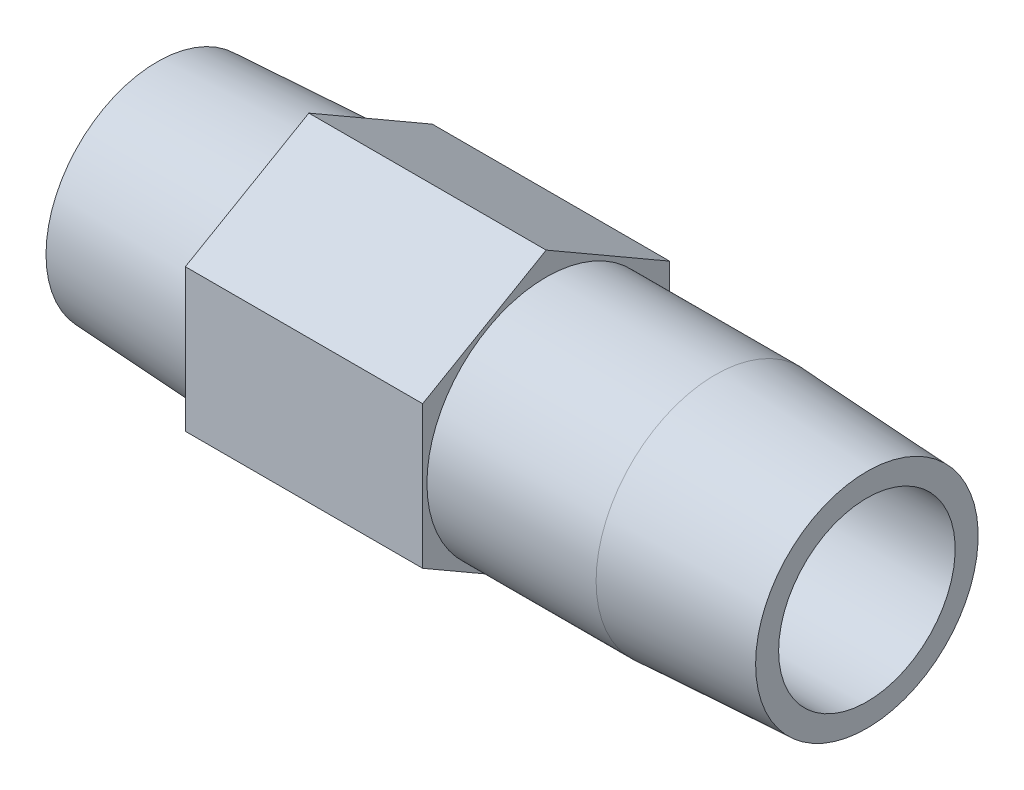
ISO-10303-21;
HEADER;
FILE_DESCRIPTION(('STEP AP214'),'2;1');
FILE_NAME('part.step','',(''),(''),'','','');
FILE_SCHEMA(('AUTOMOTIVE_DESIGN { 1 0 10303 214 1 1 1 1 }'));
ENDSEC;
DATA;
#1=APPLICATION_CONTEXT('core data for automotive mechanical design processes');
#2=APPLICATION_PROTOCOL_DEFINITION('international standard','automotive_design',2000,#1);
#3=PRODUCT_CONTEXT('',#1,'mechanical');
#4=PRODUCT('Part','Part','',(#3));
#5=PRODUCT_RELATED_PRODUCT_CATEGORY('part','',(#4));
#6=PRODUCT_DEFINITION_FORMATION('','',#4);
#7=PRODUCT_DEFINITION_CONTEXT('part definition',#1,'design');
#8=PRODUCT_DEFINITION('design','',#6,#7);
#9=PRODUCT_DEFINITION_SHAPE('','',#8);
#10=(LENGTH_UNIT() NAMED_UNIT(*) SI_UNIT(.MILLI.,.METRE.));
#11=(NAMED_UNIT(*) PLANE_ANGLE_UNIT() SI_UNIT($,.RADIAN.));
#12=(NAMED_UNIT(*) SI_UNIT($,.STERADIAN.) SOLID_ANGLE_UNIT());
#13=UNCERTAINTY_MEASURE_WITH_UNIT(LENGTH_MEASURE(1.E-05),#10,'distance_accuracy_value','');
#14=(GEOMETRIC_REPRESENTATION_CONTEXT(3) GLOBAL_UNCERTAINTY_ASSIGNED_CONTEXT((#13)) GLOBAL_UNIT_ASSIGNED_CONTEXT((#10,
#11,#12)) REPRESENTATION_CONTEXT('',''));
#15=CARTESIAN_POINT('',(0.,0.,0.));
#16=DIRECTION('',(0.,0.,1.));
#17=DIRECTION('',(1.,0.,0.));
#18=AXIS2_PLACEMENT_3D('',#15,#16,#17);
#19=CARTESIAN_POINT('',(0.,0.,-9.95716184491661));
#20=DIRECTION('',(1.,0.,0.));
#21=DIRECTION('',(0.,0.,-1.));
#22=AXIS2_PLACEMENT_3D('',#19,#20,#21);
#23=PLANE('',#22);
#24=CARTESIAN_POINT('',(0.,0.,0.));
#25=DIRECTION('',(-1.,0.,0.));
#26=DIRECTION('',(0.,0.,1.));
#27=AXIS2_PLACEMENT_3D('',#24,#25,#26);
#28=CIRCLE('',#27,9.95716184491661);
#29=CARTESIAN_POINT('',(0.,0.,9.95716184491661));
#30=VERTEX_POINT('',#29);
#31=EDGE_CURVE('E147',#30,#30,#28,.T.);
#32=ORIENTED_EDGE('',*,*,#31,.T.);
#33=EDGE_LOOP('',(#32));
#34=FACE_BOUND('',#33,.T.);
#35=CARTESIAN_POINT('',(0.,0.,0.));
#36=DIRECTION('',(1.,0.,0.));
#37=DIRECTION('',(0.,0.,1.));
#38=AXIS2_PLACEMENT_3D('',#35,#36,#37);
#39=CIRCLE('',#38,7.8994);
#40=CARTESIAN_POINT('',(0.,0.,7.8994));
#41=VERTEX_POINT('',#40);
#42=EDGE_CURVE('E159',#41,#41,#39,.T.);
#43=ORIENTED_EDGE('',*,*,#42,.T.);
#44=EDGE_LOOP('',(#43));
#45=FACE_BOUND('',#44,.T.);
#46=ADVANCED_FACE('F15',(#34,#45),#23,.F.);
#47=CARTESIAN_POINT('',(63.5,0.,-9.95716184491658));
#48=DIRECTION('',(-1.,0.,0.));
#49=DIRECTION('',(0.,0.,1.));
#50=AXIS2_PLACEMENT_3D('',#47,#48,#49);
#51=PLANE('',#50);
#52=CARTESIAN_POINT('',(63.5,0.,0.));
#53=DIRECTION('',(-1.,0.,0.));
#54=DIRECTION('',(0.,0.,1.));
#55=AXIS2_PLACEMENT_3D('',#52,#53,#54);
#56=CIRCLE('',#55,9.95716184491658);
#57=CARTESIAN_POINT('',(63.5,0.,9.95716184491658));
#58=VERTEX_POINT('',#57);
#59=EDGE_CURVE('E150',#58,#58,#56,.T.);
#60=ORIENTED_EDGE('',*,*,#59,.F.);
#61=EDGE_LOOP('',(#60));
#62=FACE_BOUND('',#61,.T.);
#63=CARTESIAN_POINT('',(63.5,0.,0.));
#64=DIRECTION('',(-1.,0.,0.));
#65=DIRECTION('',(0.,0.,1.));
#66=AXIS2_PLACEMENT_3D('',#63,#64,#65);
#67=CIRCLE('',#66,7.8994);
#68=CARTESIAN_POINT('',(63.5,0.,7.8994));
#69=VERTEX_POINT('',#68);
#70=EDGE_CURVE('E156',#69,#69,#67,.F.);
#71=ORIENTED_EDGE('',*,*,#70,.F.);
#72=EDGE_LOOP('',(#71));
#73=FACE_BOUND('',#72,.T.);
#74=ADVANCED_FACE('F178',(#62,#73),#51,.F.);
#75=CARTESIAN_POINT('',(34.798,-6.37914312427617,-11.049));
#76=DIRECTION('',(1.,0.,0.));
#77=DIRECTION('',(0.,1.,0.));
#78=AXIS2_PLACEMENT_3D('',#75,#76,#77);
#79=PLANE('',#78);
#80=DIRECTION('',(0.,0.5,-0.866025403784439));
#81=VECTOR('',#80,1.);
#82=CARTESIAN_POINT('',(34.798,-12.7582862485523,0.));
#83=LINE('',#82,#81);
#84=CARTESIAN_POINT('',(34.798,-12.7582862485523,0.));
#85=VERTEX_POINT('',#84);
#86=CARTESIAN_POINT('',(34.798,-6.37914312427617,-11.049));
#87=VERTEX_POINT('',#86);
#88=EDGE_CURVE('E103',#85,#87,#83,.T.);
#89=ORIENTED_EDGE('',*,*,#88,.T.);
#90=DIRECTION('',(0.,1.,0.));
#91=VECTOR('',#90,1.);
#92=CARTESIAN_POINT('',(34.798,-6.37914312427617,-11.049));
#93=LINE('',#92,#91);
#94=CARTESIAN_POINT('',(34.798,6.37914312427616,-11.049));
#95=VERTEX_POINT('',#94);
#96=EDGE_CURVE('E83',#87,#95,#93,.T.);
#97=ORIENTED_EDGE('',*,*,#96,.T.);
#98=DIRECTION('',(0.,0.5,0.866025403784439));
#99=VECTOR('',#98,1.);
#100=CARTESIAN_POINT('',(34.798,6.37914312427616,-11.049));
#101=LINE('',#100,#99);
#102=CARTESIAN_POINT('',(34.798,12.7582862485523,0.));
#103=VERTEX_POINT('',#102);
#104=EDGE_CURVE('E102',#95,#103,#101,.T.);
#105=ORIENTED_EDGE('',*,*,#104,.T.);
#106=DIRECTION('',(0.,-0.5,0.866025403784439));
#107=VECTOR('',#106,1.);
#108=CARTESIAN_POINT('',(34.798,12.7582862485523,0.));
#109=LINE('',#108,#107);
#110=CARTESIAN_POINT('',(34.798,6.37914312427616,11.049));
#111=VERTEX_POINT('',#110);
#112=EDGE_CURVE('E105',#103,#111,#109,.T.);
#113=ORIENTED_EDGE('',*,*,#112,.T.);
#114=DIRECTION('',(0.,-1.,0.));
#115=VECTOR('',#114,1.);
#116=CARTESIAN_POINT('',(34.798,6.37914312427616,11.049));
#117=LINE('',#116,#115);
#118=CARTESIAN_POINT('',(34.798,-6.37914312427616,11.049));
#119=VERTEX_POINT('',#118);
#120=EDGE_CURVE('E35',#111,#119,#117,.T.);
#121=ORIENTED_EDGE('',*,*,#120,.T.);
#122=DIRECTION('',(0.,-0.5,-0.866025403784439));
#123=VECTOR('',#122,1.);
#124=CARTESIAN_POINT('',(34.798,-6.37914312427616,11.049));
#125=LINE('',#124,#123);
#126=EDGE_CURVE('E30',#119,#85,#125,.T.);
#127=ORIENTED_EDGE('',*,*,#126,.T.);
#128=EDGE_LOOP('',(#89,#97,#105,#113,#121,#127));
#129=FACE_BOUND('',#128,.T.);
#130=CARTESIAN_POINT('',(34.798,0.,0.));
#131=DIRECTION('',(1.,0.,0.));
#132=DIRECTION('',(0.,1.,0.));
#133=AXIS2_PLACEMENT_3D('',#130,#131,#132);
#134=CIRCLE('',#133,10.668);
#135=CARTESIAN_POINT('',(34.798,10.668,0.));
#136=VERTEX_POINT('',#135);
#137=EDGE_CURVE('E89',#136,#136,#134,.F.);
#138=ORIENTED_EDGE('',*,*,#137,.T.);
#139=EDGE_LOOP('',(#138));
#140=FACE_BOUND('',#139,.T.);
#141=ADVANCED_FACE('F124',(#129,#140),#79,.T.);
#142=CARTESIAN_POINT('',(13.5636,-6.37914312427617,-11.049));
#143=DIRECTION('',(1.,0.,0.));
#144=DIRECTION('',(0.,1.,0.));
#145=AXIS2_PLACEMENT_3D('',#142,#143,#144);
#146=PLANE('',#145);
#147=DIRECTION('',(0.,0.5,-0.866025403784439));
#148=VECTOR('',#147,1.);
#149=CARTESIAN_POINT('',(13.5636,-12.7582862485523,0.));
#150=LINE('',#149,#148);
#151=CARTESIAN_POINT('',(13.5636,-12.7582862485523,0.));
#152=VERTEX_POINT('',#151);
#153=CARTESIAN_POINT('',(13.5636,-6.37914312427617,-11.049));
#154=VERTEX_POINT('',#153);
#155=EDGE_CURVE('E73',#152,#154,#150,.T.);
#156=ORIENTED_EDGE('',*,*,#155,.F.);
#157=DIRECTION('',(0.,-0.5,-0.866025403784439));
#158=VECTOR('',#157,1.);
#159=CARTESIAN_POINT('',(13.5636,-6.37914312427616,11.049));
#160=LINE('',#159,#158);
#161=CARTESIAN_POINT('',(13.5636,-6.37914312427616,11.049));
#162=VERTEX_POINT('',#161);
#163=EDGE_CURVE('E99',#162,#152,#160,.T.);
#164=ORIENTED_EDGE('',*,*,#163,.F.);
#165=DIRECTION('',(0.,-1.,0.));
#166=VECTOR('',#165,1.);
#167=CARTESIAN_POINT('',(13.5636,6.37914312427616,11.049));
#168=LINE('',#167,#166);
#169=CARTESIAN_POINT('',(13.5636,6.37914312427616,11.049));
#170=VERTEX_POINT('',#169);
#171=EDGE_CURVE('E133',#170,#162,#168,.T.);
#172=ORIENTED_EDGE('',*,*,#171,.F.);
#173=DIRECTION('',(0.,-0.5,0.866025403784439));
#174=VECTOR('',#173,1.);
#175=CARTESIAN_POINT('',(13.5636,12.7582862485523,0.));
#176=LINE('',#175,#174);
#177=CARTESIAN_POINT('',(13.5636,12.7582862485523,0.));
#178=VERTEX_POINT('',#177);
#179=EDGE_CURVE('E129',#178,#170,#176,.T.);
#180=ORIENTED_EDGE('',*,*,#179,.F.);
#181=DIRECTION('',(0.,0.5,0.866025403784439));
#182=VECTOR('',#181,1.);
#183=CARTESIAN_POINT('',(13.5636,6.37914312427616,-11.049));
#184=LINE('',#183,#182);
#185=CARTESIAN_POINT('',(13.5636,6.37914312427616,-11.049));
#186=VERTEX_POINT('',#185);
#187=EDGE_CURVE('E75',#186,#178,#184,.T.);
#188=ORIENTED_EDGE('',*,*,#187,.F.);
#189=DIRECTION('',(0.,1.,0.));
#190=VECTOR('',#189,1.);
#191=CARTESIAN_POINT('',(13.5636,-6.37914312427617,-11.049));
#192=LINE('',#191,#190);
#193=EDGE_CURVE('E68',#154,#186,#192,.T.);
#194=ORIENTED_EDGE('',*,*,#193,.F.);
#195=EDGE_LOOP('',(#156,#164,#172,#180,#188,#194));
#196=FACE_BOUND('',#195,.T.);
#197=CARTESIAN_POINT('',(13.5636,0.,0.));
#198=DIRECTION('',(-1.,0.,0.));
#199=DIRECTION('',(0.,0.,1.));
#200=AXIS2_PLACEMENT_3D('',#197,#198,#199);
#201=CIRCLE('',#200,10.668);
#202=CARTESIAN_POINT('',(13.5636,0.,10.668));
#203=VERTEX_POINT('',#202);
#204=EDGE_CURVE('E95',#203,#203,#201,.T.);
#205=ORIENTED_EDGE('',*,*,#204,.F.);
#206=EDGE_LOOP('',(#205));
#207=FACE_BOUND('',#206,.T.);
#208=ADVANCED_FACE('F69',(#196,#207),#146,.F.);
#209=CARTESIAN_POINT('',(34.798,-12.7582862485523,0.));
#210=DIRECTION('',(0.,0.866025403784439,0.5));
#211=DIRECTION('',(0.,-0.5,0.866025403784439));
#212=AXIS2_PLACEMENT_3D('',#209,#210,#211);
#213=PLANE('',#212);
#214=ORIENTED_EDGE('',*,*,#155,.T.);
#215=DIRECTION('',(-1.,0.,0.));
#216=VECTOR('',#215,1.);
#217=CARTESIAN_POINT('',(34.798,-6.37914312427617,-11.049));
#218=LINE('',#217,#216);
#219=EDGE_CURVE('E10',#87,#154,#218,.T.);
#220=ORIENTED_EDGE('',*,*,#219,.F.);
#221=ORIENTED_EDGE('',*,*,#88,.F.);
#222=DIRECTION('',(-1.,0.,0.));
#223=VECTOR('',#222,1.);
#224=CARTESIAN_POINT('',(34.798,-12.7582862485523,0.));
#225=LINE('',#224,#223);
#226=EDGE_CURVE('E87',#85,#152,#225,.T.);
#227=ORIENTED_EDGE('',*,*,#226,.T.);
#228=EDGE_LOOP('',(#214,#220,#221,#227));
#229=FACE_BOUND('',#228,.T.);
#230=ADVANCED_FACE('F17',(#229),#213,.F.);
#231=CARTESIAN_POINT('',(34.798,-6.37914312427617,-11.049));
#232=DIRECTION('',(0.,0.,1.));
#233=DIRECTION('',(1.,0.,0.));
#234=AXIS2_PLACEMENT_3D('',#231,#232,#233);
#235=PLANE('',#234);
#236=ORIENTED_EDGE('',*,*,#193,.T.);
#237=DIRECTION('',(-1.,0.,0.));
#238=VECTOR('',#237,1.);
#239=CARTESIAN_POINT('',(34.798,6.37914312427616,-11.049));
#240=LINE('',#239,#238);
#241=EDGE_CURVE('E23',#95,#186,#240,.T.);
#242=ORIENTED_EDGE('',*,*,#241,.F.);
#243=ORIENTED_EDGE('',*,*,#96,.F.);
#244=ORIENTED_EDGE('',*,*,#219,.T.);
#245=EDGE_LOOP('',(#236,#242,#243,#244));
#246=FACE_BOUND('',#245,.T.);
#247=ADVANCED_FACE('F82',(#246),#235,.F.);
#248=CARTESIAN_POINT('',(34.798,6.37914312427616,-11.049));
#249=DIRECTION('',(0.,-0.866025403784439,0.5));
#250=DIRECTION('',(0.,-0.5,-0.866025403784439));
#251=AXIS2_PLACEMENT_3D('',#248,#249,#250);
#252=PLANE('',#251);
#253=ORIENTED_EDGE('',*,*,#187,.T.);
#254=DIRECTION('',(-1.,0.,0.));
#255=VECTOR('',#254,1.);
#256=CARTESIAN_POINT('',(34.798,12.7582862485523,0.));
#257=LINE('',#256,#255);
#258=EDGE_CURVE('E117',#103,#178,#257,.T.);
#259=ORIENTED_EDGE('',*,*,#258,.F.);
#260=ORIENTED_EDGE('',*,*,#104,.F.);
#261=ORIENTED_EDGE('',*,*,#241,.T.);
#262=EDGE_LOOP('',(#253,#259,#260,#261));
#263=FACE_BOUND('',#262,.T.);
#264=ADVANCED_FACE('F121',(#263),#252,.F.);
#265=CARTESIAN_POINT('',(34.798,12.7582862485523,0.));
#266=DIRECTION('',(0.,-0.866025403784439,-0.5));
#267=DIRECTION('',(0.,0.5,-0.866025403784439));
#268=AXIS2_PLACEMENT_3D('',#265,#266,#267);
#269=PLANE('',#268);
#270=ORIENTED_EDGE('',*,*,#179,.T.);
#271=DIRECTION('',(-1.,0.,0.));
#272=VECTOR('',#271,1.);
#273=CARTESIAN_POINT('',(34.798,6.37914312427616,11.049));
#274=LINE('',#273,#272);
#275=EDGE_CURVE('E114',#111,#170,#274,.T.);
#276=ORIENTED_EDGE('',*,*,#275,.F.);
#277=ORIENTED_EDGE('',*,*,#112,.F.);
#278=ORIENTED_EDGE('',*,*,#258,.T.);
#279=EDGE_LOOP('',(#270,#276,#277,#278));
#280=FACE_BOUND('',#279,.T.);
#281=ADVANCED_FACE('F128',(#280),#269,.F.);
#282=CARTESIAN_POINT('',(34.798,6.37914312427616,11.049));
#283=DIRECTION('',(0.,0.,-1.));
#284=DIRECTION('',(-1.,0.,0.));
#285=AXIS2_PLACEMENT_3D('',#282,#283,#284);
#286=PLANE('',#285);
#287=ORIENTED_EDGE('',*,*,#171,.T.);
#288=DIRECTION('',(-1.,0.,0.));
#289=VECTOR('',#288,1.);
#290=CARTESIAN_POINT('',(34.798,-6.37914312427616,11.049));
#291=LINE('',#290,#289);
#292=EDGE_CURVE('E111',#119,#162,#291,.T.);
#293=ORIENTED_EDGE('',*,*,#292,.F.);
#294=ORIENTED_EDGE('',*,*,#120,.F.);
#295=ORIENTED_EDGE('',*,*,#275,.T.);
#296=EDGE_LOOP('',(#287,#293,#294,#295));
#297=FACE_BOUND('',#296,.T.);
#298=ADVANCED_FACE('F132',(#297),#286,.F.);
#299=CARTESIAN_POINT('',(34.798,-6.37914312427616,11.049));
#300=DIRECTION('',(0.,0.866025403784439,-0.5));
#301=DIRECTION('',(0.,0.5,0.866025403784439));
#302=AXIS2_PLACEMENT_3D('',#299,#300,#301);
#303=PLANE('',#302);
#304=ORIENTED_EDGE('',*,*,#163,.T.);
#305=ORIENTED_EDGE('',*,*,#226,.F.);
#306=ORIENTED_EDGE('',*,*,#126,.F.);
#307=ORIENTED_EDGE('',*,*,#292,.T.);
#308=EDGE_LOOP('',(#304,#305,#306,#307));
#309=FACE_BOUND('',#308,.T.);
#310=ADVANCED_FACE('F135',(#309),#303,.F.);
#311=CARTESIAN_POINT('',(13.5636,0.,0.));
#312=DIRECTION('',(1.,0.,0.));
#313=DIRECTION('',(0.,0.,-1.));
#314=AXIS2_PLACEMENT_3D('',#311,#312,#313);
#315=CONICAL_SURFACE('',#314,10.668,0.0523598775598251);
#316=ORIENTED_EDGE('',*,*,#31,.F.);
#317=EDGE_LOOP('',(#316));
#318=FACE_BOUND('',#317,.T.);
#319=ORIENTED_EDGE('',*,*,#204,.T.);
#320=EDGE_LOOP('',(#319));
#321=FACE_BOUND('',#320,.T.);
#322=ADVANCED_FACE('F187',(#318,#321),#315,.T.);
#323=CARTESIAN_POINT('',(-60.,0.,0.));
#324=DIRECTION('',(-1.,0.,0.));
#325=DIRECTION('',(0.,0.,1.));
#326=AXIS2_PLACEMENT_3D('',#323,#324,#325);
#327=CYLINDRICAL_SURFACE('',#326,10.668);
#328=ORIENTED_EDGE('',*,*,#137,.F.);
#329=EDGE_LOOP('',(#328));
#330=FACE_BOUND('',#329,.T.);
#331=CARTESIAN_POINT('',(49.9364,0.,0.));
#332=DIRECTION('',(-1.,0.,0.));
#333=DIRECTION('',(0.,0.,1.));
#334=AXIS2_PLACEMENT_3D('',#331,#332,#333);
#335=CIRCLE('',#334,10.668);
#336=CARTESIAN_POINT('',(49.9364,0.,10.668));
#337=VERTEX_POINT('',#336);
#338=EDGE_CURVE('E153',#337,#337,#335,.T.);
#339=ORIENTED_EDGE('',*,*,#338,.T.);
#340=EDGE_LOOP('',(#339));
#341=FACE_BOUND('',#340,.T.);
#342=ADVANCED_FACE('F174',(#330,#341),#327,.T.);
#343=CARTESIAN_POINT('',(63.5,0.,0.));
#344=DIRECTION('',(-1.,0.,0.));
#345=DIRECTION('',(0.,0.,1.));
#346=AXIS2_PLACEMENT_3D('',#343,#344,#345);
#347=CONICAL_SURFACE('',#346,9.95716184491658,0.0523598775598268);
#348=ORIENTED_EDGE('',*,*,#338,.F.);
#349=EDGE_LOOP('',(#348));
#350=FACE_BOUND('',#349,.T.);
#351=ORIENTED_EDGE('',*,*,#59,.T.);
#352=EDGE_LOOP('',(#351));
#353=FACE_BOUND('',#352,.T.);
#354=ADVANCED_FACE('F167',(#350,#353),#347,.T.);
#355=CARTESIAN_POINT('',(71.9143036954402,0.,0.));
#356=DIRECTION('',(-1.,0.,0.));
#357=DIRECTION('',(0.,0.,1.));
#358=AXIS2_PLACEMENT_3D('',#355,#356,#357);
#359=CYLINDRICAL_SURFACE('',#358,7.8994);
#360=ORIENTED_EDGE('',*,*,#70,.T.);
#361=EDGE_LOOP('',(#360));
#362=FACE_BOUND('',#361,.T.);
#363=ORIENTED_EDGE('',*,*,#42,.F.);
#364=EDGE_LOOP('',(#363));
#365=FACE_BOUND('',#364,.T.);
#366=ADVANCED_FACE('F165',(#362,#365),#359,.F.);
#367=CLOSED_SHELL('',(#46,#74,#141,#208,#230,#247,#264,#281,#298,#310,#322,#342,#354,#366));
#368=MANIFOLD_SOLID_BREP('B1',#367);
#369=ADVANCED_BREP_SHAPE_REPRESENTATION('',(#18,#368),#14);
#370=SHAPE_DEFINITION_REPRESENTATION(#9,#369);
ENDSEC;
END-ISO-10303-21;
